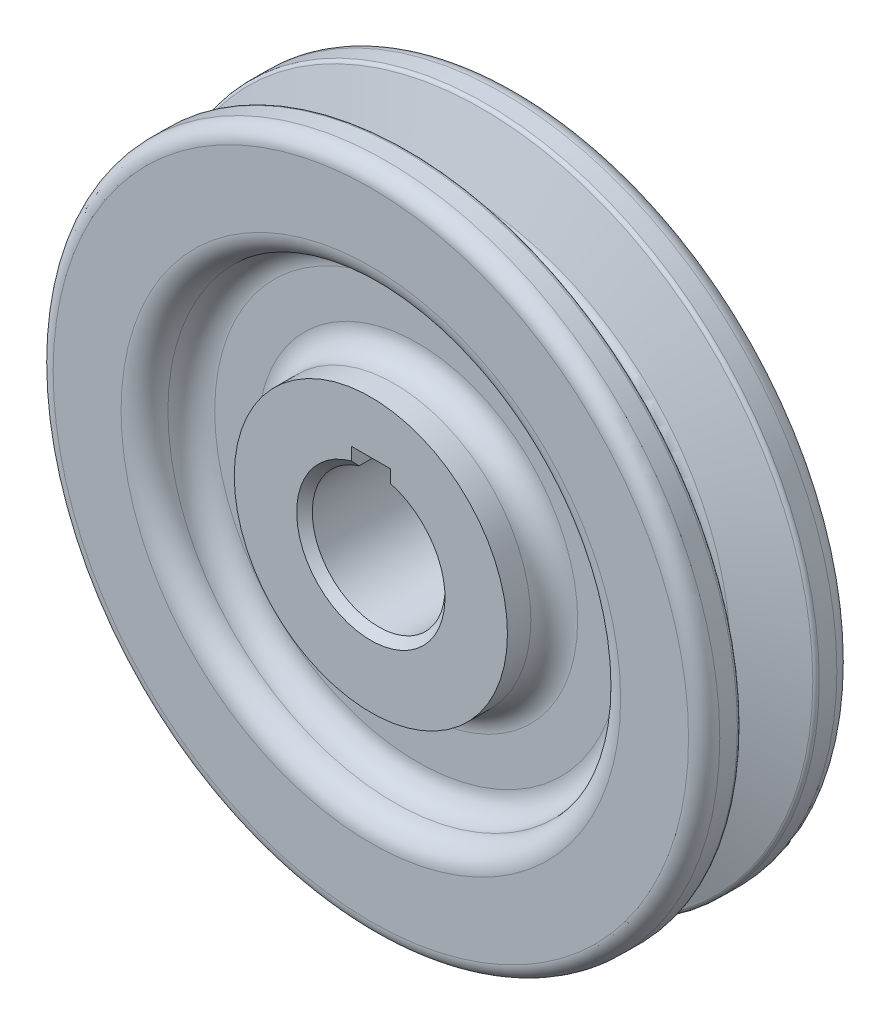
ISO-10303-21;
HEADER;
FILE_DESCRIPTION(('STEP AP214'),'2;1');
FILE_NAME('part.step','',(''),(''),'','','');
FILE_SCHEMA(('AUTOMOTIVE_DESIGN { 1 0 10303 214 1 1 1 1 }'));
ENDSEC;
DATA;
#1=APPLICATION_CONTEXT('core data for automotive mechanical design processes');
#2=APPLICATION_PROTOCOL_DEFINITION('international standard','automotive_design',2000,#1);
#3=PRODUCT_CONTEXT('',#1,'mechanical');
#4=PRODUCT('Part','Part','',(#3));
#5=PRODUCT_RELATED_PRODUCT_CATEGORY('part','',(#4));
#6=PRODUCT_DEFINITION_FORMATION('','',#4);
#7=PRODUCT_DEFINITION_CONTEXT('part definition',#1,'design');
#8=PRODUCT_DEFINITION('design','',#6,#7);
#9=PRODUCT_DEFINITION_SHAPE('','',#8);
#10=(LENGTH_UNIT() NAMED_UNIT(*) SI_UNIT(.MILLI.,.METRE.));
#11=(NAMED_UNIT(*) PLANE_ANGLE_UNIT() SI_UNIT($,.RADIAN.));
#12=(NAMED_UNIT(*) SI_UNIT($,.STERADIAN.) SOLID_ANGLE_UNIT());
#13=UNCERTAINTY_MEASURE_WITH_UNIT(LENGTH_MEASURE(1.E-05),#10,'distance_accuracy_value','');
#14=(GEOMETRIC_REPRESENTATION_CONTEXT(3) GLOBAL_UNCERTAINTY_ASSIGNED_CONTEXT((#13)) GLOBAL_UNIT_ASSIGNED_CONTEXT((#10,
#11,#12)) REPRESENTATION_CONTEXT('',''));
#15=CARTESIAN_POINT('',(0.,0.,0.));
#16=DIRECTION('',(0.,0.,1.));
#17=DIRECTION('',(1.,0.,0.));
#18=AXIS2_PLACEMENT_3D('',#15,#16,#17);
#19=CARTESIAN_POINT('',(0.,42.7,-19.));
#20=DIRECTION('',(0.,0.,1.));
#21=DIRECTION('',(1.,0.,0.));
#22=AXIS2_PLACEMENT_3D('',#19,#20,#21);
#23=PLANE('',#22);
#24=DIRECTION('',(0.,1.,0.));
#25=VECTOR('',#24,1.);
#26=CARTESIAN_POINT('',(-2.5,0.,-19.));
#27=LINE('',#26,#25);
#28=CARTESIAN_POINT('',(-2.5,9.1651513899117,-19.));
#29=VERTEX_POINT('',#28);
#30=CARTESIAN_POINT('',(-2.5,10.8,-19.));
#31=VERTEX_POINT('',#30);
#32=EDGE_CURVE('E91',#29,#31,#27,.T.);
#33=ORIENTED_EDGE('',*,*,#32,.F.);
#34=CARTESIAN_POINT('',(0.,0.,-19.));
#35=DIRECTION('',(0.,0.,1.));
#36=DIRECTION('',(1.,0.,0.));
#37=AXIS2_PLACEMENT_3D('',#34,#35,#36);
#38=CIRCLE('',#37,9.50000000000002);
#39=CARTESIAN_POINT('',(2.5,9.1651513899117,-19.));
#40=VERTEX_POINT('',#39);
#41=EDGE_CURVE('E128',#29,#40,#38,.T.);
#42=ORIENTED_EDGE('',*,*,#41,.T.);
#43=DIRECTION('',(0.,1.,0.));
#44=VECTOR('',#43,1.);
#45=CARTESIAN_POINT('',(2.5,0.,-19.));
#46=LINE('',#45,#44);
#47=CARTESIAN_POINT('',(2.5,10.8,-19.));
#48=VERTEX_POINT('',#47);
#49=EDGE_CURVE('E117',#40,#48,#46,.T.);
#50=ORIENTED_EDGE('',*,*,#49,.T.);
#51=DIRECTION('',(-1.,0.,0.));
#52=VECTOR('',#51,1.);
#53=CARTESIAN_POINT('',(0.,10.8,-19.));
#54=LINE('',#53,#52);
#55=EDGE_CURVE('E103',#48,#31,#54,.T.);
#56=ORIENTED_EDGE('',*,*,#55,.T.);
#57=EDGE_LOOP('',(#33,#42,#50,#56));
#58=FACE_BOUND('',#57,.T.);
#59=CARTESIAN_POINT('',(0.,0.,-19.));
#60=DIRECTION('',(0.,0.,-1.));
#61=DIRECTION('',(-1.,0.,0.));
#62=AXIS2_PLACEMENT_3D('',#59,#60,#61);
#63=CIRCLE('',#62,17.5);
#64=CARTESIAN_POINT('',(-17.5,0.,-19.));
#65=VERTEX_POINT('',#64);
#66=EDGE_CURVE('E243',#65,#65,#63,.T.);
#67=ORIENTED_EDGE('',*,*,#66,.T.);
#68=EDGE_LOOP('',(#67));
#69=FACE_BOUND('',#68,.T.);
#70=ADVANCED_FACE('F37',(#58,#69),#23,.F.);
#71=CARTESIAN_POINT('',(0.,0.,0.));
#72=DIRECTION('',(0.,0.,-1.));
#73=DIRECTION('',(-1.,0.,0.));
#74=AXIS2_PLACEMENT_3D('',#71,#72,#73);
#75=PLANE('',#74);
#76=DIRECTION('',(0.,1.,0.));
#77=VECTOR('',#76,1.);
#78=CARTESIAN_POINT('',(2.5,0.,0.));
#79=LINE('',#78,#77);
#80=CARTESIAN_POINT('',(2.5,9.1651513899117,0.));
#81=VERTEX_POINT('',#80);
#82=CARTESIAN_POINT('',(2.5,10.8,0.));
#83=VERTEX_POINT('',#82);
#84=EDGE_CURVE('E123',#81,#83,#79,.T.);
#85=ORIENTED_EDGE('',*,*,#84,.F.);
#86=CARTESIAN_POINT('',(0.,0.,0.));
#87=DIRECTION('',(0.,0.,-1.));
#88=DIRECTION('',(-1.,0.,0.));
#89=AXIS2_PLACEMENT_3D('',#86,#87,#88);
#90=CIRCLE('',#89,9.50000000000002);
#91=CARTESIAN_POINT('',(-2.5,9.1651513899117,0.));
#92=VERTEX_POINT('',#91);
#93=EDGE_CURVE('E52',#81,#92,#90,.T.);
#94=ORIENTED_EDGE('',*,*,#93,.T.);
#95=DIRECTION('',(0.,1.,0.));
#96=VECTOR('',#95,1.);
#97=CARTESIAN_POINT('',(-2.5,0.,0.));
#98=LINE('',#97,#96);
#99=CARTESIAN_POINT('',(-2.5,10.8,0.));
#100=VERTEX_POINT('',#99);
#101=EDGE_CURVE('E119',#92,#100,#98,.T.);
#102=ORIENTED_EDGE('',*,*,#101,.T.);
#103=DIRECTION('',(-1.,0.,0.));
#104=VECTOR('',#103,1.);
#105=CARTESIAN_POINT('',(0.,10.8,0.));
#106=LINE('',#105,#104);
#107=EDGE_CURVE('E111',#83,#100,#106,.T.);
#108=ORIENTED_EDGE('',*,*,#107,.F.);
#109=EDGE_LOOP('',(#85,#94,#102,#108));
#110=FACE_BOUND('',#109,.T.);
#111=CARTESIAN_POINT('',(0.,0.,0.));
#112=DIRECTION('',(0.,0.,1.));
#113=DIRECTION('',(1.,0.,0.));
#114=AXIS2_PLACEMENT_3D('',#111,#112,#113);
#115=CIRCLE('',#114,17.5);
#116=CARTESIAN_POINT('',(17.5,0.,0.));
#117=VERTEX_POINT('',#116);
#118=EDGE_CURVE('E125',#117,#117,#115,.T.);
#119=ORIENTED_EDGE('',*,*,#118,.T.);
#120=EDGE_LOOP('',(#119));
#121=FACE_BOUND('',#120,.T.);
#122=ADVANCED_FACE('F189',(#110,#121),#75,.F.);
#123=CARTESIAN_POINT('',(0.,0.,0.));
#124=DIRECTION('',(0.,0.,-1.));
#125=DIRECTION('',(-1.,0.,0.));
#126=AXIS2_PLACEMENT_3D('',#123,#124,#125);
#127=CIRCLE('',#126,40.7);
#128=CARTESIAN_POINT('',(-40.7,0.,0.));
#129=VERTEX_POINT('',#128);
#130=EDGE_CURVE('E268',#129,#129,#127,.F.);
#131=ORIENTED_EDGE('',*,*,#130,.T.);
#132=EDGE_LOOP('',(#131));
#133=FACE_BOUND('',#132,.T.);
#134=CARTESIAN_POINT('',(0.,0.,0.));
#135=DIRECTION('',(0.,0.,-1.));
#136=DIRECTION('',(-1.,0.,0.));
#137=AXIS2_PLACEMENT_3D('',#134,#135,#136);
#138=CIRCLE('',#137,32.);
#139=CARTESIAN_POINT('',(-32.,0.,0.));
#140=VERTEX_POINT('',#139);
#141=EDGE_CURVE('E344',#140,#140,#138,.T.);
#142=ORIENTED_EDGE('',*,*,#141,.T.);
#143=EDGE_LOOP('',(#142));
#144=FACE_BOUND('',#143,.T.);
#145=ADVANCED_FACE('F186',(#133,#144),#75,.F.);
#146=CARTESIAN_POINT('',(0.,0.,0.));
#147=DIRECTION('',(0.,0.,1.));
#148=DIRECTION('',(1.,0.,0.));
#149=AXIS2_PLACEMENT_3D('',#146,#147,#148);
#150=CYLINDRICAL_SURFACE('',#149,42.7);
#151=CARTESIAN_POINT('',(0.,0.,-2.));
#152=DIRECTION('',(0.,0.,-1.));
#153=DIRECTION('',(-1.,0.,0.));
#154=AXIS2_PLACEMENT_3D('',#151,#152,#153);
#155=CIRCLE('',#154,42.7);
#156=CARTESIAN_POINT('',(-42.7,0.,-2.));
#157=VERTEX_POINT('',#156);
#158=EDGE_CURVE('E274',#157,#157,#155,.T.);
#159=ORIENTED_EDGE('',*,*,#158,.T.);
#160=EDGE_LOOP('',(#159));
#161=FACE_BOUND('',#160,.T.);
#162=CARTESIAN_POINT('',(0.,0.,-4.25944555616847));
#163=DIRECTION('',(0.,0.,-1.));
#164=DIRECTION('',(-1.,0.,0.));
#165=AXIS2_PLACEMENT_3D('',#162,#163,#164);
#166=CIRCLE('',#165,42.7);
#167=CARTESIAN_POINT('',(-42.7,0.,-4.25944555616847));
#168=VERTEX_POINT('',#167);
#169=EDGE_CURVE('E271',#168,#168,#166,.F.);
#170=ORIENTED_EDGE('',*,*,#169,.T.);
#171=EDGE_LOOP('',(#170));
#172=FACE_BOUND('',#171,.T.);
#173=ADVANCED_FACE('F182',(#161,#172),#150,.T.);
#174=CARTESIAN_POINT('',(0.,0.,-7.54699408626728));
#175=DIRECTION('',(0.,0.,1.));
#176=DIRECTION('',(1.,0.,0.));
#177=AXIS2_PLACEMENT_3D('',#174,#175,#176);
#178=CONICAL_SURFACE('',#177,33.7,1.25663706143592);
#179=CARTESIAN_POINT('',(0.,0.,-7.32248009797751));
#180=DIRECTION('',(0.,0.,1.));
#181=DIRECTION('',(1.,0.,0.));
#182=AXIS2_PLACEMENT_3D('',#179,#180,#181);
#183=CIRCLE('',#182,34.3909830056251);
#184=CARTESIAN_POINT('',(34.3909830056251,0.,-7.32248009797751));
#185=VERTEX_POINT('',#184);
#186=EDGE_CURVE('E12',#185,#185,#183,.T.);
#187=ORIENTED_EDGE('',*,*,#186,.T.);
#188=EDGE_LOOP('',(#187));
#189=FACE_BOUND('',#188,.T.);
#190=CARTESIAN_POINT('',(0.,0.,-4.73497381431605));
#191=DIRECTION('',(0.,0.,-1.));
#192=DIRECTION('',(-1.,0.,0.));
#193=AXIS2_PLACEMENT_3D('',#190,#191,#192);
#194=CIRCLE('',#193,42.3545084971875);
#195=CARTESIAN_POINT('',(-42.3545084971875,0.,-4.73497381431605));
#196=VERTEX_POINT('',#195);
#197=EDGE_CURVE('E45',#196,#196,#194,.T.);
#198=ORIENTED_EDGE('',*,*,#197,.T.);
#199=EDGE_LOOP('',(#198));
#200=FACE_BOUND('',#199,.T.);
#201=ADVANCED_FACE('F178',(#189,#200),#178,.T.);
#202=CARTESIAN_POINT('',(0.,0.,0.));
#203=DIRECTION('',(0.,0.,1.));
#204=DIRECTION('',(1.,0.,0.));
#205=AXIS2_PLACEMENT_3D('',#202,#203,#204);
#206=CYLINDRICAL_SURFACE('',#205,33.7);
#207=CARTESIAN_POINT('',(0.,0.,-10.7264633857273));
#208=DIRECTION('',(0.,0.,1.));
#209=DIRECTION('',(1.,0.,0.));
#210=AXIS2_PLACEMENT_3D('',#207,#208,#209);
#211=CIRCLE('',#210,33.7);
#212=CARTESIAN_POINT('',(33.7,0.,-10.7264633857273));
#213=VERTEX_POINT('',#212);
#214=EDGE_CURVE('E280',#213,#213,#211,.T.);
#215=ORIENTED_EDGE('',*,*,#214,.T.);
#216=EDGE_LOOP('',(#215));
#217=FACE_BOUND('',#216,.T.);
#218=CARTESIAN_POINT('',(0.,0.,-8.27353661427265));
#219=DIRECTION('',(0.,0.,1.));
#220=DIRECTION('',(1.,0.,0.));
#221=AXIS2_PLACEMENT_3D('',#218,#219,#220);
#222=CIRCLE('',#221,33.7);
#223=CARTESIAN_POINT('',(33.7,0.,-8.27353661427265));
#224=VERTEX_POINT('',#223);
#225=EDGE_CURVE('E277',#224,#224,#222,.F.);
#226=ORIENTED_EDGE('',*,*,#225,.T.);
#227=EDGE_LOOP('',(#226));
#228=FACE_BOUND('',#227,.T.);
#229=ADVANCED_FACE('F174',(#217,#228),#206,.T.);
#230=CARTESIAN_POINT('',(0.,0.,-14.3772831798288));
#231=DIRECTION('',(0.,0.,-1.));
#232=DIRECTION('',(-1.,0.,0.));
#233=AXIS2_PLACEMENT_3D('',#230,#231,#232);
#234=CONICAL_SURFACE('',#233,42.7,1.25663706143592);
#235=CARTESIAN_POINT('',(0.,0.,-11.6775199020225));
#236=DIRECTION('',(0.,0.,-1.));
#237=DIRECTION('',(-1.,0.,0.));
#238=AXIS2_PLACEMENT_3D('',#235,#236,#237);
#239=CIRCLE('',#238,34.3909830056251);
#240=CARTESIAN_POINT('',(-34.3909830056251,0.,-11.6775199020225));
#241=VERTEX_POINT('',#240);
#242=EDGE_CURVE('E286',#241,#241,#239,.T.);
#243=ORIENTED_EDGE('',*,*,#242,.T.);
#244=EDGE_LOOP('',(#243));
#245=FACE_BOUND('',#244,.T.);
#246=CARTESIAN_POINT('',(0.,0.,-14.2650261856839));
#247=DIRECTION('',(0.,0.,1.));
#248=DIRECTION('',(1.,0.,0.));
#249=AXIS2_PLACEMENT_3D('',#246,#247,#248);
#250=CIRCLE('',#249,42.3545084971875);
#251=CARTESIAN_POINT('',(42.3545084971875,0.,-14.2650261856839));
#252=VERTEX_POINT('',#251);
#253=EDGE_CURVE('E283',#252,#252,#250,.T.);
#254=ORIENTED_EDGE('',*,*,#253,.T.);
#255=EDGE_LOOP('',(#254));
#256=FACE_BOUND('',#255,.T.);
#257=ADVANCED_FACE('F170',(#245,#256),#234,.T.);
#258=CARTESIAN_POINT('',(0.,0.,0.));
#259=DIRECTION('',(0.,0.,1.));
#260=DIRECTION('',(1.,0.,0.));
#261=AXIS2_PLACEMENT_3D('',#258,#259,#260);
#262=CYLINDRICAL_SURFACE('',#261,42.7);
#263=CARTESIAN_POINT('',(0.,0.,-17.));
#264=DIRECTION('',(0.,0.,1.));
#265=DIRECTION('',(1.,0.,0.));
#266=AXIS2_PLACEMENT_3D('',#263,#264,#265);
#267=CIRCLE('',#266,42.7);
#268=CARTESIAN_POINT('',(42.7,0.,-17.));
#269=VERTEX_POINT('',#268);
#270=EDGE_CURVE('E262',#269,#269,#267,.T.);
#271=ORIENTED_EDGE('',*,*,#270,.T.);
#272=EDGE_LOOP('',(#271));
#273=FACE_BOUND('',#272,.T.);
#274=CARTESIAN_POINT('',(0.,0.,-14.7405544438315));
#275=DIRECTION('',(0.,0.,-1.));
#276=DIRECTION('',(-1.,0.,0.));
#277=AXIS2_PLACEMENT_3D('',#274,#275,#276);
#278=CIRCLE('',#277,42.7);
#279=CARTESIAN_POINT('',(-42.7,0.,-14.7405544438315));
#280=VERTEX_POINT('',#279);
#281=EDGE_CURVE('E259',#280,#280,#278,.T.);
#282=ORIENTED_EDGE('',*,*,#281,.T.);
#283=EDGE_LOOP('',(#282));
#284=FACE_BOUND('',#283,.T.);
#285=ADVANCED_FACE('F166',(#273,#284),#262,.T.);
#286=CARTESIAN_POINT('',(0.,0.,-19.));
#287=DIRECTION('',(0.,0.,1.));
#288=DIRECTION('',(1.,0.,0.));
#289=AXIS2_PLACEMENT_3D('',#286,#287,#288);
#290=CIRCLE('',#289,40.7);
#291=CARTESIAN_POINT('',(40.7,0.,-19.));
#292=VERTEX_POINT('',#291);
#293=EDGE_CURVE('E265',#292,#292,#290,.F.);
#294=ORIENTED_EDGE('',*,*,#293,.T.);
#295=EDGE_LOOP('',(#294));
#296=FACE_BOUND('',#295,.T.);
#297=CARTESIAN_POINT('',(0.,0.,-19.));
#298=DIRECTION('',(0.,0.,1.));
#299=DIRECTION('',(1.,0.,0.));
#300=AXIS2_PLACEMENT_3D('',#297,#298,#299);
#301=CIRCLE('',#300,32.);
#302=CARTESIAN_POINT('',(32.,0.,-19.));
#303=VERTEX_POINT('',#302);
#304=EDGE_CURVE('E256',#303,#303,#301,.T.);
#305=ORIENTED_EDGE('',*,*,#304,.T.);
#306=EDGE_LOOP('',(#305));
#307=FACE_BOUND('',#306,.T.);
#308=ADVANCED_FACE('F162',(#296,#307),#23,.F.);
#309=CARTESIAN_POINT('',(0.,0.,-19.));
#310=DIRECTION('',(0.,0.,1.));
#311=DIRECTION('',(1.,0.,0.));
#312=AXIS2_PLACEMENT_3D('',#309,#310,#311);
#313=CYLINDRICAL_SURFACE('',#312,8.5);
#314=DIRECTION('',(0.,0.,1.));
#315=VECTOR('',#314,1.);
#316=CARTESIAN_POINT('',(2.5,8.12403840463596,-19.));
#317=LINE('',#316,#315);
#318=CARTESIAN_POINT('',(2.5,8.12403840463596,-18.));
#319=VERTEX_POINT('',#318);
#320=CARTESIAN_POINT('',(2.5,8.12403840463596,-1.00000000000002));
#321=VERTEX_POINT('',#320);
#322=EDGE_CURVE('E102',#319,#321,#317,.T.);
#323=ORIENTED_EDGE('',*,*,#322,.F.);
#324=CARTESIAN_POINT('',(0.,0.,-18.));
#325=DIRECTION('',(0.,0.,1.));
#326=DIRECTION('',(1.,0.,0.));
#327=AXIS2_PLACEMENT_3D('',#324,#325,#326);
#328=CIRCLE('',#327,8.5);
#329=CARTESIAN_POINT('',(-2.5,8.12403840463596,-18.));
#330=VERTEX_POINT('',#329);
#331=EDGE_CURVE('E558',#319,#330,#328,.F.);
#332=ORIENTED_EDGE('',*,*,#331,.T.);
#333=DIRECTION('',(0.,0.,1.));
#334=VECTOR('',#333,1.);
#335=CARTESIAN_POINT('',(-2.5,8.12403840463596,-19.));
#336=LINE('',#335,#334);
#337=CARTESIAN_POINT('',(-2.5,8.12403840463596,-1.00000000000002));
#338=VERTEX_POINT('',#337);
#339=EDGE_CURVE('E112',#330,#338,#336,.T.);
#340=ORIENTED_EDGE('',*,*,#339,.T.);
#341=CARTESIAN_POINT('',(0.,0.,-1.00000000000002));
#342=DIRECTION('',(0.,0.,-1.));
#343=DIRECTION('',(-1.,0.,0.));
#344=AXIS2_PLACEMENT_3D('',#341,#342,#343);
#345=CIRCLE('',#344,8.5);
#346=EDGE_CURVE('E557',#338,#321,#345,.F.);
#347=ORIENTED_EDGE('',*,*,#346,.T.);
#348=EDGE_LOOP('',(#323,#332,#340,#347));
#349=FACE_BOUND('',#348,.T.);
#350=ADVANCED_FACE('F158',(#349),#313,.F.);
#351=CARTESIAN_POINT('',(-2.5,0.,-19.));
#352=DIRECTION('',(1.,0.,0.));
#353=DIRECTION('',(0.,0.,-1.));
#354=AXIS2_PLACEMENT_3D('',#351,#352,#353);
#355=PLANE('',#354);
#356=ORIENTED_EDGE('',*,*,#339,.F.);
#357=CARTESIAN_POINT('',(-2.5,8.12403840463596,-18.));
#358=CARTESIAN_POINT('',(-2.5,8.2979454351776,-18.1662625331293));
#359=CARTESIAN_POINT('',(-2.5,8.47165837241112,-18.3327271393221));
#360=CARTESIAN_POINT('',(-2.5,8.8186960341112,-18.6660604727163));
#361=CARTESIAN_POINT('',(-2.5,8.99202075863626,-18.8329291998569));
#362=CARTESIAN_POINT('',(-2.5,9.1651513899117,-19.));
#363=B_SPLINE_CURVE_WITH_KNOTS('',3,(#357,#358,#359,#360,#361,#362),.UNSPECIFIED.,.F.,.F.,(4,2,
4),(0.,0.721789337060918,1.4435785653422),.UNSPECIFIED.);
#364=EDGE_CURVE('E97',#330,#29,#363,.T.);
#365=ORIENTED_EDGE('',*,*,#364,.T.);
#366=ORIENTED_EDGE('',*,*,#32,.T.);
#367=DIRECTION('',(0.,0.,1.));
#368=VECTOR('',#367,1.);
#369=CARTESIAN_POINT('',(-2.5,10.8,-19.));
#370=LINE('',#369,#368);
#371=EDGE_CURVE('E94',#31,#100,#370,.T.);
#372=ORIENTED_EDGE('',*,*,#371,.T.);
#373=ORIENTED_EDGE('',*,*,#101,.F.);
#374=CARTESIAN_POINT('',(-2.5,9.1651513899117,0.));
#375=CARTESIAN_POINT('',(-2.5,8.99202075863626,-0.16707080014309));
#376=CARTESIAN_POINT('',(-2.5,8.8186960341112,-0.333939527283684));
#377=CARTESIAN_POINT('',(-2.5,8.47165837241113,-0.667272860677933));
#378=CARTESIAN_POINT('',(-2.5,8.2979454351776,-0.83373746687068));
#379=CARTESIAN_POINT('',(-2.5,8.12403840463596,-1.00000000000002));
#380=B_SPLINE_CURVE_WITH_KNOTS('',3,(#374,#375,#376,#377,#378,#379),.UNSPECIFIED.,.F.,.F.,(4,2,
4),(0.,0.72178922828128,1.4435785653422),.UNSPECIFIED.);
#381=EDGE_CURVE('E59',#92,#338,#380,.T.);
#382=ORIENTED_EDGE('',*,*,#381,.T.);
#383=EDGE_LOOP('',(#356,#365,#366,#372,#373,#382));
#384=FACE_BOUND('',#383,.T.);
#385=ADVANCED_FACE('F93',(#384),#355,.T.);
#386=CARTESIAN_POINT('',(0.,10.8,-19.));
#387=DIRECTION('',(0.,1.,0.));
#388=DIRECTION('',(0.,0.,1.));
#389=AXIS2_PLACEMENT_3D('',#386,#387,#388);
#390=PLANE('',#389);
#391=ORIENTED_EDGE('',*,*,#107,.T.);
#392=ORIENTED_EDGE('',*,*,#371,.F.);
#393=ORIENTED_EDGE('',*,*,#55,.F.);
#394=DIRECTION('',(0.,0.,1.));
#395=VECTOR('',#394,1.);
#396=CARTESIAN_POINT('',(2.5,10.8,-19.));
#397=LINE('',#396,#395);
#398=EDGE_CURVE('E113',#48,#83,#397,.T.);
#399=ORIENTED_EDGE('',*,*,#398,.T.);
#400=EDGE_LOOP('',(#391,#392,#393,#399));
#401=FACE_BOUND('',#400,.T.);
#402=ADVANCED_FACE('F107',(#401),#390,.F.);
#403=CARTESIAN_POINT('',(2.5,0.,-19.));
#404=DIRECTION('',(1.,0.,0.));
#405=DIRECTION('',(0.,0.,-1.));
#406=AXIS2_PLACEMENT_3D('',#403,#404,#405);
#407=PLANE('',#406);
#408=ORIENTED_EDGE('',*,*,#49,.F.);
#409=CARTESIAN_POINT('',(2.5,9.1651513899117,-19.));
#410=CARTESIAN_POINT('',(2.5,8.99202075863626,-18.8329291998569));
#411=CARTESIAN_POINT('',(2.5,8.8186960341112,-18.6660604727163));
#412=CARTESIAN_POINT('',(2.5,8.47165837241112,-18.3327271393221));
#413=CARTESIAN_POINT('',(2.5,8.2979454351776,-18.1662625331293));
#414=CARTESIAN_POINT('',(2.5,8.12403840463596,-18.));
#415=B_SPLINE_CURVE_WITH_KNOTS('',3,(#409,#410,#411,#412,#413,#414),.UNSPECIFIED.,.F.,.F.,(4,2,
4),(0.,0.721789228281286,1.44357856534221),.UNSPECIFIED.);
#416=EDGE_CURVE('E141',#40,#319,#415,.T.);
#417=ORIENTED_EDGE('',*,*,#416,.T.);
#418=ORIENTED_EDGE('',*,*,#322,.T.);
#419=CARTESIAN_POINT('',(2.5,8.12403840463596,-1.00000000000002));
#420=CARTESIAN_POINT('',(2.5,8.2979454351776,-0.833737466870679));
#421=CARTESIAN_POINT('',(2.5,8.47165837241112,-0.667272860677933));
#422=CARTESIAN_POINT('',(2.5,8.8186960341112,-0.333939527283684));
#423=CARTESIAN_POINT('',(2.5,8.99202075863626,-0.16707080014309));
#424=CARTESIAN_POINT('',(2.5,9.1651513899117,0.));
#425=B_SPLINE_CURVE_WITH_KNOTS('',3,(#419,#420,#421,#422,#423,#424),.UNSPECIFIED.,.F.,.F.,(4,2,
4),(0.,0.721789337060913,1.44357856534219),.UNSPECIFIED.);
#426=EDGE_CURVE('E134',#321,#81,#425,.T.);
#427=ORIENTED_EDGE('',*,*,#426,.T.);
#428=ORIENTED_EDGE('',*,*,#84,.T.);
#429=ORIENTED_EDGE('',*,*,#398,.F.);
#430=EDGE_LOOP('',(#408,#417,#418,#427,#428,#429));
#431=FACE_BOUND('',#430,.T.);
#432=ADVANCED_FACE('F150',(#431),#407,.F.);
#433=CARTESIAN_POINT('',(0.,0.,-19.));
#434=DIRECTION('',(0.,0.,-1.));
#435=DIRECTION('',(-1.,0.,0.));
#436=AXIS2_PLACEMENT_3D('',#433,#434,#435);
#437=CONICAL_SURFACE('',#436,9.50000000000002,0.785398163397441);
#438=ORIENTED_EDGE('',*,*,#364,.F.);
#439=ORIENTED_EDGE('',*,*,#331,.F.);
#440=ORIENTED_EDGE('',*,*,#416,.F.);
#441=ORIENTED_EDGE('',*,*,#41,.F.);
#442=EDGE_LOOP('',(#438,#439,#440,#441));
#443=FACE_BOUND('',#442,.T.);
#444=ADVANCED_FACE('F155',(#443),#437,.F.);
#445=CARTESIAN_POINT('',(0.,0.,-1.00000000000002));
#446=DIRECTION('',(0.,0.,1.));
#447=DIRECTION('',(1.,0.,0.));
#448=AXIS2_PLACEMENT_3D('',#445,#446,#447);
#449=CONICAL_SURFACE('',#448,8.5,0.785398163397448);
#450=ORIENTED_EDGE('',*,*,#381,.F.);
#451=ORIENTED_EDGE('',*,*,#93,.F.);
#452=ORIENTED_EDGE('',*,*,#426,.F.);
#453=ORIENTED_EDGE('',*,*,#346,.F.);
#454=EDGE_LOOP('',(#450,#451,#452,#453));
#455=FACE_BOUND('',#454,.T.);
#456=ADVANCED_FACE('F147',(#455),#449,.F.);
#457=CARTESIAN_POINT('',(0.,0.,-6.));
#458=DIRECTION('',(0.,0.,1.));
#459=DIRECTION('',(1.,0.,0.));
#460=AXIS2_PLACEMENT_3D('',#457,#458,#459);
#461=PLANE('',#460);
#462=CARTESIAN_POINT('',(0.,0.,-6.));
#463=DIRECTION('',(0.,0.,1.));
#464=DIRECTION('',(1.,0.,0.));
#465=AXIS2_PLACEMENT_3D('',#462,#463,#464);
#466=CIRCLE('',#465,20.5);
#467=CARTESIAN_POINT('',(20.5,0.,-6.));
#468=VERTEX_POINT('',#467);
#469=EDGE_CURVE('E347',#468,#468,#466,.F.);
#470=ORIENTED_EDGE('',*,*,#469,.T.);
#471=EDGE_LOOP('',(#470));
#472=FACE_BOUND('',#471,.T.);
#473=CARTESIAN_POINT('',(0.,0.,-6.));
#474=DIRECTION('',(0.,0.,1.));
#475=DIRECTION('',(1.,0.,0.));
#476=AXIS2_PLACEMENT_3D('',#473,#474,#475);
#477=CIRCLE('',#476,26.);
#478=CARTESIAN_POINT('',(26.,0.,-6.));
#479=VERTEX_POINT('',#478);
#480=EDGE_CURVE('E352',#479,#479,#477,.T.);
#481=ORIENTED_EDGE('',*,*,#480,.T.);
#482=EDGE_LOOP('',(#481));
#483=FACE_BOUND('',#482,.T.);
#484=ADVANCED_FACE('F209',(#472,#483),#461,.T.);
#485=CARTESIAN_POINT('',(0.,0.,-6.));
#486=DIRECTION('',(0.,0.,1.));
#487=DIRECTION('',(1.,0.,0.));
#488=AXIS2_PLACEMENT_3D('',#485,#486,#487);
#489=CYLINDRICAL_SURFACE('',#488,17.5);
#490=CARTESIAN_POINT('',(0.,0.,-3.));
#491=DIRECTION('',(0.,0.,1.));
#492=DIRECTION('',(1.,0.,0.));
#493=AXIS2_PLACEMENT_3D('',#490,#491,#492);
#494=CIRCLE('',#493,17.5);
#495=CARTESIAN_POINT('',(17.5,0.,-3.));
#496=VERTEX_POINT('',#495);
#497=EDGE_CURVE('E371',#496,#496,#494,.T.);
#498=ORIENTED_EDGE('',*,*,#497,.T.);
#499=EDGE_LOOP('',(#498));
#500=FACE_BOUND('',#499,.T.);
#501=ORIENTED_EDGE('',*,*,#118,.F.);
#502=EDGE_LOOP('',(#501));
#503=FACE_BOUND('',#502,.T.);
#504=ADVANCED_FACE('F213',(#500,#503),#489,.T.);
#505=CARTESIAN_POINT('',(0.,0.,-13.));
#506=DIRECTION('',(0.,0.,-1.));
#507=DIRECTION('',(-1.,0.,0.));
#508=AXIS2_PLACEMENT_3D('',#505,#506,#507);
#509=PLANE('',#508);
#510=CARTESIAN_POINT('',(0.,0.,-13.));
#511=DIRECTION('',(0.,0.,-1.));
#512=DIRECTION('',(-1.,0.,0.));
#513=AXIS2_PLACEMENT_3D('',#510,#511,#512);
#514=CIRCLE('',#513,20.5);
#515=CARTESIAN_POINT('',(-20.5,0.,-13.));
#516=VERTEX_POINT('',#515);
#517=EDGE_CURVE('E357',#516,#516,#514,.F.);
#518=ORIENTED_EDGE('',*,*,#517,.T.);
#519=EDGE_LOOP('',(#518));
#520=FACE_BOUND('',#519,.T.);
#521=CARTESIAN_POINT('',(0.,0.,-13.));
#522=DIRECTION('',(0.,0.,-1.));
#523=DIRECTION('',(-1.,0.,0.));
#524=AXIS2_PLACEMENT_3D('',#521,#522,#523);
#525=CIRCLE('',#524,26.);
#526=CARTESIAN_POINT('',(-26.,0.,-13.));
#527=VERTEX_POINT('',#526);
#528=EDGE_CURVE('E349',#527,#527,#525,.T.);
#529=ORIENTED_EDGE('',*,*,#528,.T.);
#530=EDGE_LOOP('',(#529));
#531=FACE_BOUND('',#530,.T.);
#532=ADVANCED_FACE('F217',(#520,#531),#509,.T.);
#533=CARTESIAN_POINT('',(0.,0.,-13.));
#534=DIRECTION('',(0.,0.,-1.));
#535=DIRECTION('',(-1.,0.,0.));
#536=AXIS2_PLACEMENT_3D('',#533,#534,#535);
#537=CYLINDRICAL_SURFACE('',#536,17.5);
#538=CARTESIAN_POINT('',(0.,0.,-16.));
#539=DIRECTION('',(0.,0.,-1.));
#540=DIRECTION('',(-1.,0.,0.));
#541=AXIS2_PLACEMENT_3D('',#538,#539,#540);
#542=CIRCLE('',#541,17.5);
#543=CARTESIAN_POINT('',(-17.5,0.,-16.));
#544=VERTEX_POINT('',#543);
#545=EDGE_CURVE('E346',#544,#544,#542,.T.);
#546=ORIENTED_EDGE('',*,*,#545,.T.);
#547=EDGE_LOOP('',(#546));
#548=FACE_BOUND('',#547,.T.);
#549=ORIENTED_EDGE('',*,*,#66,.F.);
#550=EDGE_LOOP('',(#549));
#551=FACE_BOUND('',#550,.T.);
#552=ADVANCED_FACE('F221',(#548,#551),#537,.T.);
#553=CARTESIAN_POINT('',(0.,0.,-3.));
#554=DIRECTION('',(0.,0.,1.));
#555=DIRECTION('',(1.,0.,0.));
#556=AXIS2_PLACEMENT_3D('',#553,#554,#555);
#557=TOROIDAL_SURFACE('',#556,20.5,3.);
#558=ORIENTED_EDGE('',*,*,#469,.F.);
#559=EDGE_LOOP('',(#558));
#560=FACE_BOUND('',#559,.T.);
#561=ORIENTED_EDGE('',*,*,#497,.F.);
#562=EDGE_LOOP('',(#561));
#563=FACE_BOUND('',#562,.T.);
#564=ADVANCED_FACE('F224',(#560,#563),#557,.F.);
#565=CARTESIAN_POINT('',(0.,0.,-3.));
#566=DIRECTION('',(0.,0.,1.));
#567=DIRECTION('',(1.,0.,0.));
#568=AXIS2_PLACEMENT_3D('',#565,#566,#567);
#569=TOROIDAL_SURFACE('',#568,26.,3.);
#570=ORIENTED_EDGE('',*,*,#480,.F.);
#571=EDGE_LOOP('',(#570));
#572=FACE_BOUND('',#571,.T.);
#573=CARTESIAN_POINT('',(0.,0.,-3.));
#574=DIRECTION('',(0.,0.,1.));
#575=DIRECTION('',(1.,0.,0.));
#576=AXIS2_PLACEMENT_3D('',#573,#574,#575);
#577=CIRCLE('',#576,29.);
#578=CARTESIAN_POINT('',(29.,0.,-3.));
#579=VERTEX_POINT('',#578);
#580=EDGE_CURVE('E245',#579,#579,#577,.F.);
#581=ORIENTED_EDGE('',*,*,#580,.F.);
#582=EDGE_LOOP('',(#581));
#583=FACE_BOUND('',#582,.T.);
#584=ADVANCED_FACE('F229',(#572,#583),#569,.F.);
#585=CARTESIAN_POINT('',(0.,0.,-3.));
#586=DIRECTION('',(0.,0.,-1.));
#587=DIRECTION('',(-1.,0.,0.));
#588=AXIS2_PLACEMENT_3D('',#585,#586,#587);
#589=TOROIDAL_SURFACE('',#588,32.,3.);
#590=ORIENTED_EDGE('',*,*,#141,.F.);
#591=EDGE_LOOP('',(#590));
#592=FACE_BOUND('',#591,.T.);
#593=ORIENTED_EDGE('',*,*,#580,.T.);
#594=EDGE_LOOP('',(#593));
#595=FACE_BOUND('',#594,.T.);
#596=ADVANCED_FACE('F333',(#592,#595),#589,.T.);
#597=CARTESIAN_POINT('',(0.,0.,-16.));
#598=DIRECTION('',(0.,0.,-1.));
#599=DIRECTION('',(-1.,0.,0.));
#600=AXIS2_PLACEMENT_3D('',#597,#598,#599);
#601=TOROIDAL_SURFACE('',#600,20.5,3.);
#602=ORIENTED_EDGE('',*,*,#517,.F.);
#603=EDGE_LOOP('',(#602));
#604=FACE_BOUND('',#603,.T.);
#605=ORIENTED_EDGE('',*,*,#545,.F.);
#606=EDGE_LOOP('',(#605));
#607=FACE_BOUND('',#606,.T.);
#608=ADVANCED_FACE('F326',(#604,#607),#601,.F.);
#609=CARTESIAN_POINT('',(0.,0.,-16.));
#610=DIRECTION('',(0.,0.,-1.));
#611=DIRECTION('',(-1.,0.,0.));
#612=AXIS2_PLACEMENT_3D('',#609,#610,#611);
#613=TOROIDAL_SURFACE('',#612,26.,3.);
#614=ORIENTED_EDGE('',*,*,#528,.F.);
#615=EDGE_LOOP('',(#614));
#616=FACE_BOUND('',#615,.T.);
#617=CARTESIAN_POINT('',(0.,0.,-16.));
#618=DIRECTION('',(0.,0.,-1.));
#619=DIRECTION('',(-1.,0.,0.));
#620=AXIS2_PLACEMENT_3D('',#617,#618,#619);
#621=CIRCLE('',#620,29.);
#622=CARTESIAN_POINT('',(-29.,0.,-16.));
#623=VERTEX_POINT('',#622);
#624=EDGE_CURVE('E249',#623,#623,#621,.F.);
#625=ORIENTED_EDGE('',*,*,#624,.F.);
#626=EDGE_LOOP('',(#625));
#627=FACE_BOUND('',#626,.T.);
#628=ADVANCED_FACE('F323',(#616,#627),#613,.F.);
#629=CARTESIAN_POINT('',(0.,0.,-16.));
#630=DIRECTION('',(0.,0.,1.));
#631=DIRECTION('',(1.,0.,0.));
#632=AXIS2_PLACEMENT_3D('',#629,#630,#631);
#633=TOROIDAL_SURFACE('',#632,32.,3.);
#634=ORIENTED_EDGE('',*,*,#304,.F.);
#635=EDGE_LOOP('',(#634));
#636=FACE_BOUND('',#635,.T.);
#637=ORIENTED_EDGE('',*,*,#624,.T.);
#638=EDGE_LOOP('',(#637));
#639=FACE_BOUND('',#638,.T.);
#640=ADVANCED_FACE('F321',(#636,#639),#633,.T.);
#641=CARTESIAN_POINT('',(0.,0.,-17.));
#642=DIRECTION('',(0.,0.,1.));
#643=DIRECTION('',(1.,0.,0.));
#644=AXIS2_PLACEMENT_3D('',#641,#642,#643);
#645=TOROIDAL_SURFACE('',#644,40.7,2.);
#646=ORIENTED_EDGE('',*,*,#293,.F.);
#647=EDGE_LOOP('',(#646));
#648=FACE_BOUND('',#647,.T.);
#649=ORIENTED_EDGE('',*,*,#270,.F.);
#650=EDGE_LOOP('',(#649));
#651=FACE_BOUND('',#650,.T.);
#652=ADVANCED_FACE('F317',(#648,#651),#645,.T.);
#653=CARTESIAN_POINT('',(0.,0.,-2.));
#654=DIRECTION('',(0.,0.,-1.));
#655=DIRECTION('',(-1.,0.,0.));
#656=AXIS2_PLACEMENT_3D('',#653,#654,#655);
#657=TOROIDAL_SURFACE('',#656,40.7,2.);
#658=ORIENTED_EDGE('',*,*,#158,.F.);
#659=EDGE_LOOP('',(#658));
#660=FACE_BOUND('',#659,.T.);
#661=ORIENTED_EDGE('',*,*,#130,.F.);
#662=EDGE_LOOP('',(#661));
#663=FACE_BOUND('',#662,.T.);
#664=ADVANCED_FACE('F313',(#660,#663),#657,.T.);
#665=CARTESIAN_POINT('',(0.,0.,-10.7264633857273));
#666=DIRECTION('',(0.,0.,1.));
#667=DIRECTION('',(1.,0.,0.));
#668=AXIS2_PLACEMENT_3D('',#665,#666,#667);
#669=TOROIDAL_SURFACE('',#668,34.7,1.);
#670=ORIENTED_EDGE('',*,*,#242,.F.);
#671=EDGE_LOOP('',(#670));
#672=FACE_BOUND('',#671,.T.);
#673=ORIENTED_EDGE('',*,*,#214,.F.);
#674=EDGE_LOOP('',(#673));
#675=FACE_BOUND('',#674,.T.);
#676=ADVANCED_FACE('F305',(#672,#675),#669,.F.);
#677=CARTESIAN_POINT('',(0.,0.,-8.27353661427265));
#678=DIRECTION('',(0.,0.,1.));
#679=DIRECTION('',(1.,0.,0.));
#680=AXIS2_PLACEMENT_3D('',#677,#678,#679);
#681=TOROIDAL_SURFACE('',#680,34.7,1.);
#682=ORIENTED_EDGE('',*,*,#225,.F.);
#683=EDGE_LOOP('',(#682));
#684=FACE_BOUND('',#683,.T.);
#685=ORIENTED_EDGE('',*,*,#186,.F.);
#686=EDGE_LOOP('',(#685));
#687=FACE_BOUND('',#686,.T.);
#688=ADVANCED_FACE('F300',(#684,#687),#681,.F.);
#689=CARTESIAN_POINT('',(0.,0.,-14.7405544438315));
#690=DIRECTION('',(0.,0.,-1.));
#691=DIRECTION('',(-1.,0.,0.));
#692=AXIS2_PLACEMENT_3D('',#689,#690,#691);
#693=TOROIDAL_SURFACE('',#692,42.2,0.5);
#694=ORIENTED_EDGE('',*,*,#281,.F.);
#695=EDGE_LOOP('',(#694));
#696=FACE_BOUND('',#695,.T.);
#697=ORIENTED_EDGE('',*,*,#253,.F.);
#698=EDGE_LOOP('',(#697));
#699=FACE_BOUND('',#698,.T.);
#700=ADVANCED_FACE('F294',(#696,#699),#693,.T.);
#701=CARTESIAN_POINT('',(0.,0.,-4.25944555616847));
#702=DIRECTION('',(0.,0.,-1.));
#703=DIRECTION('',(-1.,0.,0.));
#704=AXIS2_PLACEMENT_3D('',#701,#702,#703);
#705=TOROIDAL_SURFACE('',#704,42.2,0.5);
#706=ORIENTED_EDGE('',*,*,#197,.F.);
#707=EDGE_LOOP('',(#706));
#708=FACE_BOUND('',#707,.T.);
#709=ORIENTED_EDGE('',*,*,#169,.F.);
#710=EDGE_LOOP('',(#709));
#711=FACE_BOUND('',#710,.T.);
#712=ADVANCED_FACE('F39',(#708,#711),#705,.T.);
#713=CLOSED_SHELL('',(#70,#122,#145,#173,#201,#229,#257,#285,#308,#350,#385,#402,#432,#444,#456,
#484,#504,#532,#552,#564,#584,#596,#608,#628,#640,#652,#664,#676,#688,#700,#712));
#714=MANIFOLD_SOLID_BREP('B2',#713);
#715=ADVANCED_BREP_SHAPE_REPRESENTATION('',(#18,#714),#14);
#716=SHAPE_DEFINITION_REPRESENTATION(#9,#715);
ENDSEC;
END-ISO-10303-21;
